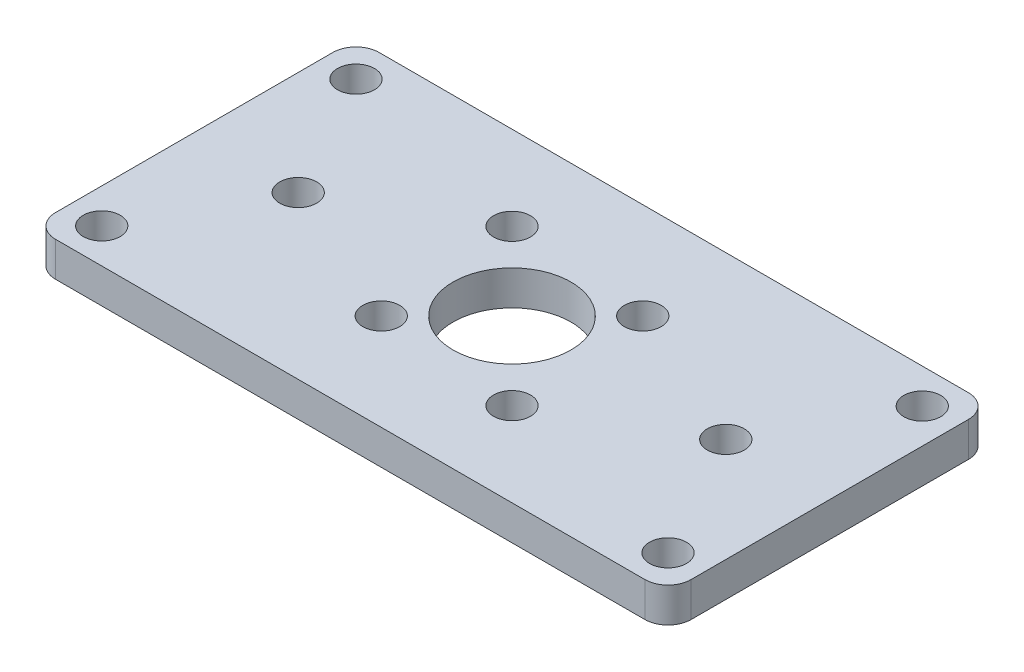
from build123d import *

# Parameters (mm, degrees)
SKETCH_1_W          = 55
SKETCH_1_H          = 28
SKETCH_1_R          = 5.1
SKETCH_1_R_2        = 1.6
EXTRUDE_1_DEPTH     = 3
SKETCH_2_R          = 1.6
CUT_EXTRUDE_1_DEPTH = 32.004031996
FILLET_1_R          = 2


with BuildPart() as part:
    # Sketch 1 → Extrude 1 (new body)
    with BuildSketch(Plane(origin=(0, 0, 0), x_dir=(1, 0, 0), z_dir=(0, 1, 0))):
        Rectangle(SKETCH_1_W, SKETCH_1_H)
        with Locations(Location((0, 0, 0), (0, 0, 270))):
            Circle(SKETCH_1_R, mode=Mode.SUBTRACT)
        with Locations(Location((5.656854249, 5.656854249, 0), (0, 0, 270))):
            Circle(SKETCH_1_R_2, mode=Mode.SUBTRACT)
        with Locations(Location((-5.656854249, -5.656854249, 0), (0, 0, 270))):
            Circle(SKETCH_1_R_2, mode=Mode.SUBTRACT)
        with Locations(Location((6.717514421, -6.717514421, 0), (0, 0, 270))):
            Circle(SKETCH_1_R_2, mode=Mode.SUBTRACT)
        with Locations(Location((-6.717514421, 6.717514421, 0), (0, 0, 270))):
            Circle(SKETCH_1_R_2, mode=Mode.SUBTRACT)
    extrude(amount=EXTRUDE_1_DEPTH)

    # Sketch 2 → Cut-Extrude 1 (cut, through all)
    with BuildSketch(Plane(origin=(0, 3, 0), x_dir=(1, 0, 0), z_dir=(0, 1, 0))):
        with Locations(Location((-24.5, 11, 0), (0, 0, 270))):
            Circle(SKETCH_2_R)
        with Locations(Location((-24.5, -11, 0), (0, 0, 270))):
            Circle(SKETCH_2_R)
        with Locations(Location((24.5, 11, 0), (0, 0, 90))):
            Circle(SKETCH_2_R)
        with Locations(Location((24.5, -11, 0), (0, 0, 90))):
            Circle(SKETCH_2_R)
        with Locations((422.703102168, 0)):
            Circle(SKETCH_2_R)
        with Locations(Location((18.5, 0, 0), (0, 0, 270))):
            Circle(SKETCH_2_R)
        with Locations(Location((-18.5, 0, 0), (0, 0, 90))):
            Circle(SKETCH_2_R)
    extrude(amount=-CUT_EXTRUDE_1_DEPTH, mode=Mode.SUBTRACT)

    # Fillet 1
    fillet_1_edges = [part.edges().sort_by_distance(p)[0] for p in [
        (27.5, 1.5, 14),
        (-27.5, 1.5, 14),
        (-27.5, 1.5, -14),
        (27.5, 1.5, -14),
    ]]
    fillet(fillet_1_edges, radius=FILLET_1_R)


solid = part.part
